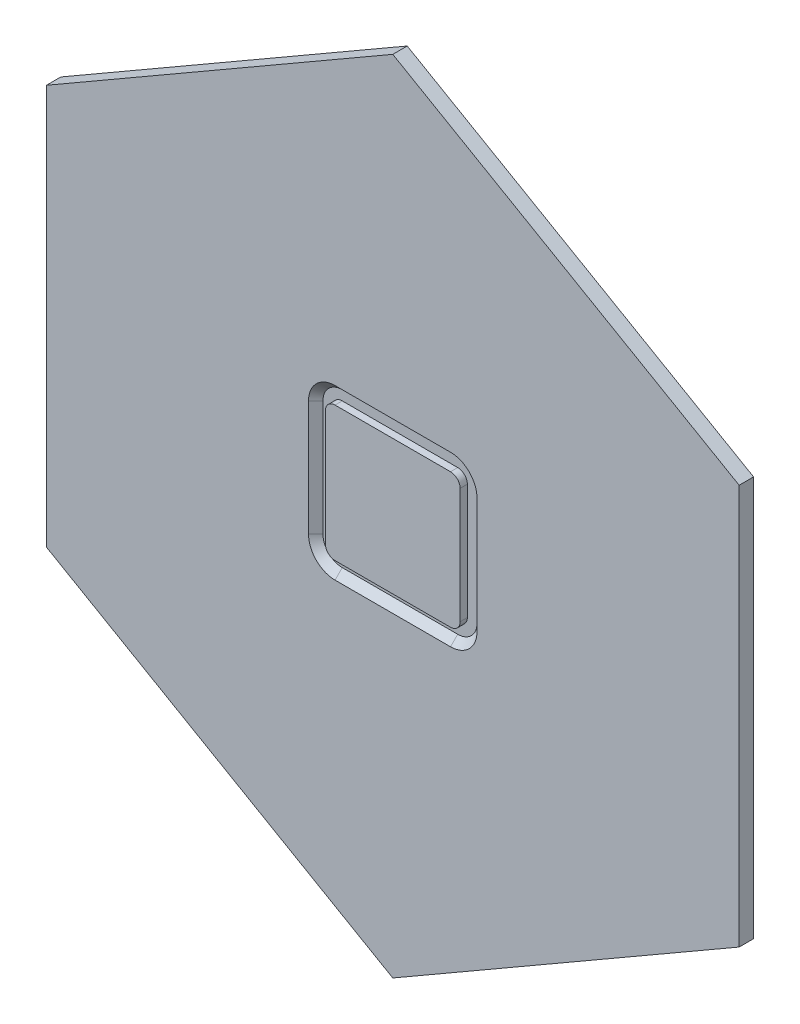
ISO-10303-21;
HEADER;
FILE_DESCRIPTION(('STEP AP214'),'2;1');
FILE_NAME('part.step','',(''),(''),'','','');
FILE_SCHEMA(('AUTOMOTIVE_DESIGN { 1 0 10303 214 1 1 1 1 }'));
ENDSEC;
DATA;
#1=APPLICATION_CONTEXT('core data for automotive mechanical design processes');
#2=APPLICATION_PROTOCOL_DEFINITION('international standard','automotive_design',2000,#1);
#3=PRODUCT_CONTEXT('',#1,'mechanical');
#4=PRODUCT('Part','Part','',(#3));
#5=PRODUCT_RELATED_PRODUCT_CATEGORY('part','',(#4));
#6=PRODUCT_DEFINITION_FORMATION('','',#4);
#7=PRODUCT_DEFINITION_CONTEXT('part definition',#1,'design');
#8=PRODUCT_DEFINITION('design','',#6,#7);
#9=PRODUCT_DEFINITION_SHAPE('','',#8);
#10=(LENGTH_UNIT() NAMED_UNIT(*) SI_UNIT(.MILLI.,.METRE.));
#11=(NAMED_UNIT(*) PLANE_ANGLE_UNIT() SI_UNIT($,.RADIAN.));
#12=(NAMED_UNIT(*) SI_UNIT($,.STERADIAN.) SOLID_ANGLE_UNIT());
#13=UNCERTAINTY_MEASURE_WITH_UNIT(LENGTH_MEASURE(1.E-05),#10,'distance_accuracy_value','');
#14=(GEOMETRIC_REPRESENTATION_CONTEXT(3) GLOBAL_UNCERTAINTY_ASSIGNED_CONTEXT((#13)) GLOBAL_UNIT_ASSIGNED_CONTEXT((#10,
#11,#12)) REPRESENTATION_CONTEXT('',''));
#15=CARTESIAN_POINT('',(0.,0.,0.));
#16=DIRECTION('',(0.,0.,1.));
#17=DIRECTION('',(1.,0.,0.));
#18=AXIS2_PLACEMENT_3D('',#15,#16,#17);
#19=CARTESIAN_POINT('',(0.,0.,9.52500000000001));
#20=DIRECTION('',(0.,0.,1.));
#21=DIRECTION('',(1.,0.,0.));
#22=AXIS2_PLACEMENT_3D('',#19,#20,#21);
#23=PLANE('',#22);
#24=DIRECTION('',(-1.,0.,0.));
#25=VECTOR('',#24,1.);
#26=CARTESIAN_POINT('',(0.,-111.2,9.52500000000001));
#27=LINE('',#26,#25);
#28=CARTESIAN_POINT('',(76.2,-111.2,9.52500000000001));
#29=VERTEX_POINT('',#28);
#30=CARTESIAN_POINT('',(-76.2,-111.2,9.52500000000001));
#31=VERTEX_POINT('',#30);
#32=EDGE_CURVE('E342',#29,#31,#27,.T.);
#33=ORIENTED_EDGE('',*,*,#32,.T.);
#34=CARTESIAN_POINT('',(-76.2,-76.2,9.52500000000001));
#35=DIRECTION('',(0.,0.,1.));
#36=DIRECTION('',(1.,0.,0.));
#37=AXIS2_PLACEMENT_3D('',#34,#35,#36);
#38=CIRCLE('',#37,35.0000000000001);
#39=CARTESIAN_POINT('',(-111.2,-76.2,9.52500000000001));
#40=VERTEX_POINT('',#39);
#41=EDGE_CURVE('E345',#31,#40,#38,.F.);
#42=ORIENTED_EDGE('',*,*,#41,.T.);
#43=DIRECTION('',(0.,1.,0.));
#44=VECTOR('',#43,1.);
#45=CARTESIAN_POINT('',(-111.2,0.,9.52500000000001));
#46=LINE('',#45,#44);
#47=CARTESIAN_POINT('',(-111.2,76.2,9.52500000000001));
#48=VERTEX_POINT('',#47);
#49=EDGE_CURVE('E325',#40,#48,#46,.T.);
#50=ORIENTED_EDGE('',*,*,#49,.T.);
#51=CARTESIAN_POINT('',(-76.2,76.2,9.52500000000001));
#52=DIRECTION('',(0.,0.,1.));
#53=DIRECTION('',(1.,0.,0.));
#54=AXIS2_PLACEMENT_3D('',#51,#52,#53);
#55=CIRCLE('',#54,35.0000000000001);
#56=CARTESIAN_POINT('',(-76.2,111.2,9.52500000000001));
#57=VERTEX_POINT('',#56);
#58=EDGE_CURVE('E327',#48,#57,#55,.F.);
#59=ORIENTED_EDGE('',*,*,#58,.T.);
#60=DIRECTION('',(1.,0.,0.));
#61=VECTOR('',#60,1.);
#62=CARTESIAN_POINT('',(0.,111.2,9.52500000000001));
#63=LINE('',#62,#61);
#64=CARTESIAN_POINT('',(76.2,111.2,9.52500000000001));
#65=VERTEX_POINT('',#64);
#66=EDGE_CURVE('E330',#57,#65,#63,.T.);
#67=ORIENTED_EDGE('',*,*,#66,.T.);
#68=CARTESIAN_POINT('',(76.2,76.2,9.52500000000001));
#69=DIRECTION('',(0.,0.,1.));
#70=DIRECTION('',(1.,0.,0.));
#71=AXIS2_PLACEMENT_3D('',#68,#69,#70);
#72=CIRCLE('',#71,35.0000000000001);
#73=CARTESIAN_POINT('',(111.2,76.2,9.52500000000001));
#74=VERTEX_POINT('',#73);
#75=EDGE_CURVE('E333',#65,#74,#72,.F.);
#76=ORIENTED_EDGE('',*,*,#75,.T.);
#77=DIRECTION('',(0.,-1.,0.));
#78=VECTOR('',#77,1.);
#79=CARTESIAN_POINT('',(111.2,0.,9.52500000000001));
#80=LINE('',#79,#78);
#81=CARTESIAN_POINT('',(111.2,-76.2,9.52500000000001));
#82=VERTEX_POINT('',#81);
#83=EDGE_CURVE('E336',#74,#82,#80,.T.);
#84=ORIENTED_EDGE('',*,*,#83,.T.);
#85=CARTESIAN_POINT('',(76.2,-76.2,9.52500000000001));
#86=DIRECTION('',(0.,0.,1.));
#87=DIRECTION('',(1.,0.,0.));
#88=AXIS2_PLACEMENT_3D('',#85,#86,#87);
#89=CIRCLE('',#88,35.0000000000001);
#90=EDGE_CURVE('E339',#82,#29,#89,.F.);
#91=ORIENTED_EDGE('',*,*,#90,.T.);
#92=EDGE_LOOP('',(#33,#42,#50,#59,#67,#76,#84,#91));
#93=FACE_BOUND('',#92,.T.);
#94=DIRECTION('',(0.,1.,0.));
#95=VECTOR('',#94,1.);
#96=CARTESIAN_POINT('',(457.2,-263.964543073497,9.52500000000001));
#97=LINE('',#96,#95);
#98=CARTESIAN_POINT('',(457.2,-263.964543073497,9.52500000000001));
#99=VERTEX_POINT('',#98);
#100=CARTESIAN_POINT('',(457.2,263.964543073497,9.52500000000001));
#101=VERTEX_POINT('',#100);
#102=EDGE_CURVE('E207',#99,#101,#97,.T.);
#103=ORIENTED_EDGE('',*,*,#102,.T.);
#104=DIRECTION('',(-0.866025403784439,0.5,0.));
#105=VECTOR('',#104,1.);
#106=CARTESIAN_POINT('',(457.2,263.964543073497,9.52500000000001));
#107=LINE('',#106,#105);
#108=CARTESIAN_POINT('',(0.,527.929086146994,9.52500000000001));
#109=VERTEX_POINT('',#108);
#110=EDGE_CURVE('E195',#101,#109,#107,.T.);
#111=ORIENTED_EDGE('',*,*,#110,.T.);
#112=DIRECTION('',(-0.866025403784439,-0.5,0.));
#113=VECTOR('',#112,1.);
#114=CARTESIAN_POINT('',(0.,527.929086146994,9.52500000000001));
#115=LINE('',#114,#113);
#116=CARTESIAN_POINT('',(-457.2,263.964543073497,9.52500000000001));
#117=VERTEX_POINT('',#116);
#118=EDGE_CURVE('E206',#109,#117,#115,.T.);
#119=ORIENTED_EDGE('',*,*,#118,.T.);
#120=DIRECTION('',(0.,-1.,0.));
#121=VECTOR('',#120,1.);
#122=CARTESIAN_POINT('',(-457.2,263.964543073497,9.52500000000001));
#123=LINE('',#122,#121);
#124=CARTESIAN_POINT('',(-457.2,-263.964543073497,9.52500000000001));
#125=VERTEX_POINT('',#124);
#126=EDGE_CURVE('E560',#117,#125,#123,.T.);
#127=ORIENTED_EDGE('',*,*,#126,.T.);
#128=DIRECTION('',(0.866025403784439,-0.5,0.));
#129=VECTOR('',#128,1.);
#130=CARTESIAN_POINT('',(-457.2,-263.964543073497,9.52500000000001));
#131=LINE('',#130,#129);
#132=CARTESIAN_POINT('',(0.,-527.929086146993,9.52500000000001));
#133=VERTEX_POINT('',#132);
#134=EDGE_CURVE('E566',#125,#133,#131,.T.);
#135=ORIENTED_EDGE('',*,*,#134,.T.);
#136=DIRECTION('',(0.866025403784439,0.5,0.));
#137=VECTOR('',#136,1.);
#138=CARTESIAN_POINT('',(0.,-527.929086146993,9.52500000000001));
#139=LINE('',#138,#137);
#140=EDGE_CURVE('E211',#133,#99,#139,.T.);
#141=ORIENTED_EDGE('',*,*,#140,.T.);
#142=EDGE_LOOP('',(#103,#111,#119,#127,#135,#141));
#143=FACE_BOUND('',#142,.T.);
#144=ADVANCED_FACE('F48',(#93,#143),#23,.T.);
#145=CARTESIAN_POINT('',(-76.2,76.2,0.));
#146=DIRECTION('',(0.,0.,1.));
#147=DIRECTION('',(1.,0.,0.));
#148=AXIS2_PLACEMENT_3D('',#145,#146,#147);
#149=PLANE('',#148);
#150=CARTESIAN_POINT('',(-76.2,76.2,0.));
#151=DIRECTION('',(0.,0.,1.));
#152=DIRECTION('',(1.,0.,0.));
#153=AXIS2_PLACEMENT_3D('',#150,#151,#152);
#154=CIRCLE('',#153,25.4750000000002);
#155=CARTESIAN_POINT('',(-76.2,101.675,0.));
#156=VERTEX_POINT('',#155);
#157=CARTESIAN_POINT('',(-101.675,76.2,0.));
#158=VERTEX_POINT('',#157);
#159=EDGE_CURVE('E60',#156,#158,#154,.T.);
#160=ORIENTED_EDGE('',*,*,#159,.T.);
#161=DIRECTION('',(0.,1.,0.));
#162=VECTOR('',#161,1.);
#163=CARTESIAN_POINT('',(-101.675,76.2,0.));
#164=LINE('',#163,#162);
#165=CARTESIAN_POINT('',(-101.675,-76.2,0.));
#166=VERTEX_POINT('',#165);
#167=EDGE_CURVE('E11',#158,#166,#164,.F.);
#168=ORIENTED_EDGE('',*,*,#167,.T.);
#169=CARTESIAN_POINT('',(-76.2,-76.2,0.));
#170=DIRECTION('',(0.,0.,1.));
#171=DIRECTION('',(1.,0.,0.));
#172=AXIS2_PLACEMENT_3D('',#169,#170,#171);
#173=CIRCLE('',#172,25.4750000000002);
#174=CARTESIAN_POINT('',(-76.2,-101.675,0.));
#175=VERTEX_POINT('',#174);
#176=EDGE_CURVE('E349',#166,#175,#173,.T.);
#177=ORIENTED_EDGE('',*,*,#176,.T.);
#178=DIRECTION('',(-1.,0.,0.));
#179=VECTOR('',#178,1.);
#180=CARTESIAN_POINT('',(76.2,-101.675,0.));
#181=LINE('',#180,#179);
#182=CARTESIAN_POINT('',(76.2,-101.675,0.));
#183=VERTEX_POINT('',#182);
#184=EDGE_CURVE('E353',#175,#183,#181,.F.);
#185=ORIENTED_EDGE('',*,*,#184,.T.);
#186=CARTESIAN_POINT('',(76.2,-76.2,0.));
#187=DIRECTION('',(0.,0.,1.));
#188=DIRECTION('',(1.,0.,0.));
#189=AXIS2_PLACEMENT_3D('',#186,#187,#188);
#190=CIRCLE('',#189,25.4750000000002);
#191=CARTESIAN_POINT('',(101.675,-76.2,0.));
#192=VERTEX_POINT('',#191);
#193=EDGE_CURVE('E356',#183,#192,#190,.T.);
#194=ORIENTED_EDGE('',*,*,#193,.T.);
#195=DIRECTION('',(0.,-1.,0.));
#196=VECTOR('',#195,1.);
#197=CARTESIAN_POINT('',(101.675,-76.2,0.));
#198=LINE('',#197,#196);
#199=CARTESIAN_POINT('',(101.675,76.2,0.));
#200=VERTEX_POINT('',#199);
#201=EDGE_CURVE('E359',#192,#200,#198,.F.);
#202=ORIENTED_EDGE('',*,*,#201,.T.);
#203=CARTESIAN_POINT('',(76.2,76.2,0.));
#204=DIRECTION('',(0.,0.,1.));
#205=DIRECTION('',(1.,0.,0.));
#206=AXIS2_PLACEMENT_3D('',#203,#204,#205);
#207=CIRCLE('',#206,25.4750000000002);
#208=CARTESIAN_POINT('',(76.2,101.675,0.));
#209=VERTEX_POINT('',#208);
#210=EDGE_CURVE('E362',#200,#209,#207,.T.);
#211=ORIENTED_EDGE('',*,*,#210,.T.);
#212=DIRECTION('',(1.,0.,0.));
#213=VECTOR('',#212,1.);
#214=CARTESIAN_POINT('',(-76.2,101.675,0.));
#215=LINE('',#214,#213);
#216=EDGE_CURVE('E365',#209,#156,#215,.F.);
#217=ORIENTED_EDGE('',*,*,#216,.T.);
#218=EDGE_LOOP('',(#160,#168,#177,#185,#194,#202,#211,#217));
#219=FACE_BOUND('',#218,.T.);
#220=CARTESIAN_POINT('',(-76.2,-76.2,0.));
#221=DIRECTION('',(0.,0.,1.));
#222=DIRECTION('',(1.,0.,0.));
#223=AXIS2_PLACEMENT_3D('',#220,#221,#222);
#224=CIRCLE('',#223,12.7);
#225=CARTESIAN_POINT('',(-88.9,-76.2,0.));
#226=VERTEX_POINT('',#225);
#227=CARTESIAN_POINT('',(-76.2,-88.9,0.));
#228=VERTEX_POINT('',#227);
#229=EDGE_CURVE('E269',#226,#228,#224,.T.);
#230=ORIENTED_EDGE('',*,*,#229,.F.);
#231=DIRECTION('',(0.,-1.,0.));
#232=VECTOR('',#231,1.);
#233=CARTESIAN_POINT('',(-88.9000000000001,76.2,0.));
#234=LINE('',#233,#232);
#235=CARTESIAN_POINT('',(-88.9000000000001,76.2,0.));
#236=VERTEX_POINT('',#235);
#237=EDGE_CURVE('E240',#236,#226,#234,.T.);
#238=ORIENTED_EDGE('',*,*,#237,.F.);
#239=CARTESIAN_POINT('',(-76.2,76.2,0.));
#240=DIRECTION('',(0.,0.,1.));
#241=DIRECTION('',(1.,0.,0.));
#242=AXIS2_PLACEMENT_3D('',#239,#240,#241);
#243=CIRCLE('',#242,12.7);
#244=CARTESIAN_POINT('',(-76.2,88.9,0.));
#245=VERTEX_POINT('',#244);
#246=EDGE_CURVE('E293',#245,#236,#243,.T.);
#247=ORIENTED_EDGE('',*,*,#246,.F.);
#248=DIRECTION('',(-1.,0.,0.));
#249=VECTOR('',#248,1.);
#250=CARTESIAN_POINT('',(-76.2,88.9,0.));
#251=LINE('',#250,#249);
#252=CARTESIAN_POINT('',(76.2,88.9,0.));
#253=VERTEX_POINT('',#252);
#254=EDGE_CURVE('E289',#253,#245,#251,.T.);
#255=ORIENTED_EDGE('',*,*,#254,.F.);
#256=CARTESIAN_POINT('',(76.2,76.2,0.));
#257=DIRECTION('',(0.,0.,1.));
#258=DIRECTION('',(1.,0.,0.));
#259=AXIS2_PLACEMENT_3D('',#256,#257,#258);
#260=CIRCLE('',#259,12.7);
#261=CARTESIAN_POINT('',(88.9,76.2,0.));
#262=VERTEX_POINT('',#261);
#263=EDGE_CURVE('E285',#262,#253,#260,.T.);
#264=ORIENTED_EDGE('',*,*,#263,.F.);
#265=DIRECTION('',(0.,1.,0.));
#266=VECTOR('',#265,1.);
#267=CARTESIAN_POINT('',(88.9,-76.2,0.));
#268=LINE('',#267,#266);
#269=CARTESIAN_POINT('',(88.9,-76.2,0.));
#270=VERTEX_POINT('',#269);
#271=EDGE_CURVE('E281',#270,#262,#268,.T.);
#272=ORIENTED_EDGE('',*,*,#271,.F.);
#273=CARTESIAN_POINT('',(76.2,-76.2,0.));
#274=DIRECTION('',(0.,0.,1.));
#275=DIRECTION('',(1.,0.,0.));
#276=AXIS2_PLACEMENT_3D('',#273,#274,#275);
#277=CIRCLE('',#276,12.7);
#278=CARTESIAN_POINT('',(76.2,-88.9,0.));
#279=VERTEX_POINT('',#278);
#280=EDGE_CURVE('E277',#279,#270,#277,.T.);
#281=ORIENTED_EDGE('',*,*,#280,.F.);
#282=DIRECTION('',(1.,0.,0.));
#283=VECTOR('',#282,1.);
#284=CARTESIAN_POINT('',(76.2,-88.9,0.));
#285=LINE('',#284,#283);
#286=EDGE_CURVE('E273',#228,#279,#285,.T.);
#287=ORIENTED_EDGE('',*,*,#286,.F.);
#288=EDGE_LOOP('',(#230,#238,#247,#255,#264,#272,#281,#287));
#289=FACE_BOUND('',#288,.T.);
#290=ADVANCED_FACE('F420',(#219,#289),#149,.T.);
#291=CARTESIAN_POINT('',(-76.2,-76.2,9.52500000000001));
#292=DIRECTION('',(0.,0.,-1.));
#293=DIRECTION('',(-1.,0.,0.));
#294=AXIS2_PLACEMENT_3D('',#291,#292,#293);
#295=CYLINDRICAL_SURFACE('',#294,12.7);
#296=ORIENTED_EDGE('',*,*,#229,.T.);
#297=DIRECTION('',(0.,0.,-1.));
#298=VECTOR('',#297,1.);
#299=CARTESIAN_POINT('',(-76.2,-88.9,9.52500000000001));
#300=LINE('',#299,#298);
#301=CARTESIAN_POINT('',(-76.2,-88.9,9.52500000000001));
#302=VERTEX_POINT('',#301);
#303=EDGE_CURVE('E321',#302,#228,#300,.T.);
#304=ORIENTED_EDGE('',*,*,#303,.F.);
#305=CARTESIAN_POINT('',(-76.2,-76.2,9.52500000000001));
#306=DIRECTION('',(0.,0.,1.));
#307=DIRECTION('',(1.,0.,0.));
#308=AXIS2_PLACEMENT_3D('',#305,#306,#307);
#309=CIRCLE('',#308,12.7);
#310=CARTESIAN_POINT('',(-88.9,-76.2,9.52500000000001));
#311=VERTEX_POINT('',#310);
#312=EDGE_CURVE('E235',#311,#302,#309,.T.);
#313=ORIENTED_EDGE('',*,*,#312,.F.);
#314=DIRECTION('',(0.,0.,-1.));
#315=VECTOR('',#314,1.);
#316=CARTESIAN_POINT('',(-88.9,-76.2,9.52500000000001));
#317=LINE('',#316,#315);
#318=EDGE_CURVE('E268',#311,#226,#317,.T.);
#319=ORIENTED_EDGE('',*,*,#318,.T.);
#320=EDGE_LOOP('',(#296,#304,#313,#319));
#321=FACE_BOUND('',#320,.T.);
#322=ADVANCED_FACE('F454',(#321),#295,.T.);
#323=CARTESIAN_POINT('',(76.2,-88.9,9.52500000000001));
#324=DIRECTION('',(0.,1.,0.));
#325=DIRECTION('',(0.,0.,1.));
#326=AXIS2_PLACEMENT_3D('',#323,#324,#325);
#327=PLANE('',#326);
#328=ORIENTED_EDGE('',*,*,#286,.T.);
#329=DIRECTION('',(0.,0.,-1.));
#330=VECTOR('',#329,1.);
#331=CARTESIAN_POINT('',(76.2,-88.9,9.52500000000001));
#332=LINE('',#331,#330);
#333=CARTESIAN_POINT('',(76.2,-88.9,9.52500000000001));
#334=VERTEX_POINT('',#333);
#335=EDGE_CURVE('E318',#334,#279,#332,.T.);
#336=ORIENTED_EDGE('',*,*,#335,.F.);
#337=DIRECTION('',(1.,0.,0.));
#338=VECTOR('',#337,1.);
#339=CARTESIAN_POINT('',(76.2,-88.9,9.52500000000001));
#340=LINE('',#339,#338);
#341=EDGE_CURVE('E239',#302,#334,#340,.T.);
#342=ORIENTED_EDGE('',*,*,#341,.F.);
#343=ORIENTED_EDGE('',*,*,#303,.T.);
#344=EDGE_LOOP('',(#328,#336,#342,#343));
#345=FACE_BOUND('',#344,.T.);
#346=ADVANCED_FACE('F495',(#345),#327,.F.);
#347=CARTESIAN_POINT('',(76.2,-76.2,9.52500000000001));
#348=DIRECTION('',(0.,0.,-1.));
#349=DIRECTION('',(-1.,0.,0.));
#350=AXIS2_PLACEMENT_3D('',#347,#348,#349);
#351=CYLINDRICAL_SURFACE('',#350,12.7);
#352=ORIENTED_EDGE('',*,*,#280,.T.);
#353=DIRECTION('',(0.,0.,-1.));
#354=VECTOR('',#353,1.);
#355=CARTESIAN_POINT('',(88.9,-76.2,9.52500000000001));
#356=LINE('',#355,#354);
#357=CARTESIAN_POINT('',(88.9,-76.2,9.52500000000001));
#358=VERTEX_POINT('',#357);
#359=EDGE_CURVE('E315',#358,#270,#356,.T.);
#360=ORIENTED_EDGE('',*,*,#359,.F.);
#361=CARTESIAN_POINT('',(76.2,-76.2,9.52500000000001));
#362=DIRECTION('',(0.,0.,1.));
#363=DIRECTION('',(1.,0.,0.));
#364=AXIS2_PLACEMENT_3D('',#361,#362,#363);
#365=CIRCLE('',#364,12.7);
#366=EDGE_CURVE('E244',#334,#358,#365,.T.);
#367=ORIENTED_EDGE('',*,*,#366,.F.);
#368=ORIENTED_EDGE('',*,*,#335,.T.);
#369=EDGE_LOOP('',(#352,#360,#367,#368));
#370=FACE_BOUND('',#369,.T.);
#371=ADVANCED_FACE('F492',(#370),#351,.T.);
#372=CARTESIAN_POINT('',(88.9,-76.2,9.52500000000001));
#373=DIRECTION('',(-1.,0.,0.));
#374=DIRECTION('',(0.,0.,1.));
#375=AXIS2_PLACEMENT_3D('',#372,#373,#374);
#376=PLANE('',#375);
#377=ORIENTED_EDGE('',*,*,#271,.T.);
#378=DIRECTION('',(0.,0.,-1.));
#379=VECTOR('',#378,1.);
#380=CARTESIAN_POINT('',(88.9,76.2,9.52500000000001));
#381=LINE('',#380,#379);
#382=CARTESIAN_POINT('',(88.9,76.2,9.52500000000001));
#383=VERTEX_POINT('',#382);
#384=EDGE_CURVE('E312',#383,#262,#381,.T.);
#385=ORIENTED_EDGE('',*,*,#384,.F.);
#386=DIRECTION('',(0.,1.,0.));
#387=VECTOR('',#386,1.);
#388=CARTESIAN_POINT('',(88.9,-76.2,9.52500000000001));
#389=LINE('',#388,#387);
#390=EDGE_CURVE('E248',#358,#383,#389,.T.);
#391=ORIENTED_EDGE('',*,*,#390,.F.);
#392=ORIENTED_EDGE('',*,*,#359,.T.);
#393=EDGE_LOOP('',(#377,#385,#391,#392));
#394=FACE_BOUND('',#393,.T.);
#395=ADVANCED_FACE('F489',(#394),#376,.F.);
#396=CARTESIAN_POINT('',(76.2,76.2,9.52500000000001));
#397=DIRECTION('',(0.,0.,-1.));
#398=DIRECTION('',(-1.,0.,0.));
#399=AXIS2_PLACEMENT_3D('',#396,#397,#398);
#400=CYLINDRICAL_SURFACE('',#399,12.7);
#401=ORIENTED_EDGE('',*,*,#263,.T.);
#402=DIRECTION('',(0.,0.,-1.));
#403=VECTOR('',#402,1.);
#404=CARTESIAN_POINT('',(76.2,88.8999999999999,9.52500000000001));
#405=LINE('',#404,#403);
#406=CARTESIAN_POINT('',(76.2,88.8999999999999,9.52500000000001));
#407=VERTEX_POINT('',#406);
#408=EDGE_CURVE('E309',#407,#253,#405,.T.);
#409=ORIENTED_EDGE('',*,*,#408,.F.);
#410=CARTESIAN_POINT('',(76.2,76.2,9.52500000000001));
#411=DIRECTION('',(0.,0.,1.));
#412=DIRECTION('',(1.,0.,0.));
#413=AXIS2_PLACEMENT_3D('',#410,#411,#412);
#414=CIRCLE('',#413,12.7);
#415=EDGE_CURVE('E252',#383,#407,#414,.T.);
#416=ORIENTED_EDGE('',*,*,#415,.F.);
#417=ORIENTED_EDGE('',*,*,#384,.T.);
#418=EDGE_LOOP('',(#401,#409,#416,#417));
#419=FACE_BOUND('',#418,.T.);
#420=ADVANCED_FACE('F485',(#419),#400,.T.);
#421=CARTESIAN_POINT('',(-76.2,88.8999999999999,9.52500000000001));
#422=DIRECTION('',(0.,-1.,0.));
#423=DIRECTION('',(0.,0.,-1.));
#424=AXIS2_PLACEMENT_3D('',#421,#422,#423);
#425=PLANE('',#424);
#426=ORIENTED_EDGE('',*,*,#254,.T.);
#427=DIRECTION('',(0.,0.,-1.));
#428=VECTOR('',#427,1.);
#429=CARTESIAN_POINT('',(-76.2,88.9,9.52500000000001));
#430=LINE('',#429,#428);
#431=CARTESIAN_POINT('',(-76.2,88.9,9.52500000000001));
#432=VERTEX_POINT('',#431);
#433=EDGE_CURVE('E306',#432,#245,#430,.T.);
#434=ORIENTED_EDGE('',*,*,#433,.F.);
#435=DIRECTION('',(-1.,0.,0.));
#436=VECTOR('',#435,1.);
#437=CARTESIAN_POINT('',(-76.2,88.8999999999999,9.52500000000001));
#438=LINE('',#437,#436);
#439=EDGE_CURVE('E256',#407,#432,#438,.T.);
#440=ORIENTED_EDGE('',*,*,#439,.F.);
#441=ORIENTED_EDGE('',*,*,#408,.T.);
#442=EDGE_LOOP('',(#426,#434,#440,#441));
#443=FACE_BOUND('',#442,.T.);
#444=ADVANCED_FACE('F481',(#443),#425,.F.);
#445=CARTESIAN_POINT('',(-76.2,76.2,9.52500000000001));
#446=DIRECTION('',(0.,0.,-1.));
#447=DIRECTION('',(-1.,0.,0.));
#448=AXIS2_PLACEMENT_3D('',#445,#446,#447);
#449=CYLINDRICAL_SURFACE('',#448,12.7);
#450=ORIENTED_EDGE('',*,*,#246,.T.);
#451=DIRECTION('',(0.,0.,-1.));
#452=VECTOR('',#451,1.);
#453=CARTESIAN_POINT('',(-88.9000000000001,76.2,9.52500000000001));
#454=LINE('',#453,#452);
#455=CARTESIAN_POINT('',(-88.9000000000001,76.2,9.52500000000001));
#456=VERTEX_POINT('',#455);
#457=EDGE_CURVE('E303',#456,#236,#454,.T.);
#458=ORIENTED_EDGE('',*,*,#457,.F.);
#459=CARTESIAN_POINT('',(-76.2,76.2,9.52500000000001));
#460=DIRECTION('',(0.,0.,1.));
#461=DIRECTION('',(1.,0.,0.));
#462=AXIS2_PLACEMENT_3D('',#459,#460,#461);
#463=CIRCLE('',#462,12.7);
#464=EDGE_CURVE('E260',#432,#456,#463,.T.);
#465=ORIENTED_EDGE('',*,*,#464,.F.);
#466=ORIENTED_EDGE('',*,*,#433,.T.);
#467=EDGE_LOOP('',(#450,#458,#465,#466));
#468=FACE_BOUND('',#467,.T.);
#469=ADVANCED_FACE('F467',(#468),#449,.T.);
#470=CARTESIAN_POINT('',(-88.9000000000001,76.2,9.52500000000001));
#471=DIRECTION('',(1.,0.,0.));
#472=DIRECTION('',(0.,1.,0.));
#473=AXIS2_PLACEMENT_3D('',#470,#471,#472);
#474=PLANE('',#473);
#475=ORIENTED_EDGE('',*,*,#237,.T.);
#476=ORIENTED_EDGE('',*,*,#318,.F.);
#477=DIRECTION('',(0.,-1.,0.));
#478=VECTOR('',#477,1.);
#479=CARTESIAN_POINT('',(-88.9000000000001,76.2,9.52500000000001));
#480=LINE('',#479,#478);
#481=EDGE_CURVE('E264',#456,#311,#480,.T.);
#482=ORIENTED_EDGE('',*,*,#481,.F.);
#483=ORIENTED_EDGE('',*,*,#457,.T.);
#484=EDGE_LOOP('',(#475,#476,#482,#483));
#485=FACE_BOUND('',#484,.T.);
#486=ADVANCED_FACE('F459',(#485),#474,.F.);
#487=ORIENTED_EDGE('',*,*,#312,.T.);
#488=ORIENTED_EDGE('',*,*,#341,.T.);
#489=ORIENTED_EDGE('',*,*,#366,.T.);
#490=ORIENTED_EDGE('',*,*,#390,.T.);
#491=ORIENTED_EDGE('',*,*,#415,.T.);
#492=ORIENTED_EDGE('',*,*,#439,.T.);
#493=ORIENTED_EDGE('',*,*,#464,.T.);
#494=ORIENTED_EDGE('',*,*,#481,.T.);
#495=EDGE_LOOP('',(#487,#488,#489,#490,#491,#492,#493,#494));
#496=FACE_BOUND('',#495,.T.);
#497=ADVANCED_FACE('F447',(#496),#23,.T.);
#498=CARTESIAN_POINT('',(76.2,76.2,-0.0749999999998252));
#499=DIRECTION('',(0.,0.,1.));
#500=DIRECTION('',(1.,0.,0.));
#501=AXIS2_PLACEMENT_3D('',#498,#499,#500);
#502=CONICAL_SURFACE('',#501,25.4,0.785398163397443);
#503=DIRECTION('',(-0.707106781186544,0.,-0.707106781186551));
#504=VECTOR('',#503,1.);
#505=CARTESIAN_POINT('',(111.2,76.2,9.52500000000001));
#506=LINE('',#505,#504);
#507=EDGE_CURVE('E387',#74,#200,#506,.T.);
#508=ORIENTED_EDGE('',*,*,#507,.F.);
#509=ORIENTED_EDGE('',*,*,#75,.F.);
#510=DIRECTION('',(0.,0.707106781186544,0.707106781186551));
#511=VECTOR('',#510,1.);
#512=CARTESIAN_POINT('',(76.2,101.6,-0.0749999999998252));
#513=LINE('',#512,#511);
#514=EDGE_CURVE('E53',#209,#65,#513,.T.);
#515=ORIENTED_EDGE('',*,*,#514,.F.);
#516=ORIENTED_EDGE('',*,*,#210,.F.);
#517=EDGE_LOOP('',(#508,#509,#515,#516));
#518=FACE_BOUND('',#517,.T.);
#519=ADVANCED_FACE('F51',(#518),#502,.F.);
#520=CARTESIAN_POINT('',(-76.2,101.6,-0.0749999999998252));
#521=DIRECTION('',(0.,0.707106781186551,-0.707106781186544));
#522=DIRECTION('',(-1.,0.,0.));
#523=AXIS2_PLACEMENT_3D('',#520,#521,#522);
#524=PLANE('',#523);
#525=ORIENTED_EDGE('',*,*,#514,.T.);
#526=ORIENTED_EDGE('',*,*,#66,.F.);
#527=DIRECTION('',(0.,0.707106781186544,0.707106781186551));
#528=VECTOR('',#527,1.);
#529=CARTESIAN_POINT('',(-76.2,101.6,-0.0749999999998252));
#530=LINE('',#529,#528);
#531=EDGE_CURVE('E384',#156,#57,#530,.T.);
#532=ORIENTED_EDGE('',*,*,#531,.F.);
#533=ORIENTED_EDGE('',*,*,#216,.F.);
#534=EDGE_LOOP('',(#525,#526,#532,#533));
#535=FACE_BOUND('',#534,.T.);
#536=ADVANCED_FACE('F404',(#535),#524,.F.);
#537=CARTESIAN_POINT('',(101.6,-76.2,-0.0749999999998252));
#538=DIRECTION('',(0.707106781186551,0.,-0.707106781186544));
#539=DIRECTION('',(0.,1.,0.));
#540=AXIS2_PLACEMENT_3D('',#537,#538,#539);
#541=PLANE('',#540);
#542=ORIENTED_EDGE('',*,*,#507,.T.);
#543=ORIENTED_EDGE('',*,*,#201,.F.);
#544=DIRECTION('',(-0.707106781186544,0.,-0.707106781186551));
#545=VECTOR('',#544,1.);
#546=CARTESIAN_POINT('',(111.2,-76.2,9.52500000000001));
#547=LINE('',#546,#545);
#548=EDGE_CURVE('E380',#82,#192,#547,.T.);
#549=ORIENTED_EDGE('',*,*,#548,.F.);
#550=ORIENTED_EDGE('',*,*,#83,.F.);
#551=EDGE_LOOP('',(#542,#543,#549,#550));
#552=FACE_BOUND('',#551,.T.);
#553=ADVANCED_FACE('F435',(#552),#541,.F.);
#554=CARTESIAN_POINT('',(-76.2,76.2,-0.0749999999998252));
#555=DIRECTION('',(0.,0.,1.));
#556=DIRECTION('',(1.,0.,0.));
#557=AXIS2_PLACEMENT_3D('',#554,#555,#556);
#558=CONICAL_SURFACE('',#557,25.4,0.785398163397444);
#559=ORIENTED_EDGE('',*,*,#531,.T.);
#560=ORIENTED_EDGE('',*,*,#58,.F.);
#561=DIRECTION('',(-0.707106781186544,0.,0.707106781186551));
#562=VECTOR('',#561,1.);
#563=CARTESIAN_POINT('',(-101.6,76.2,-0.0749999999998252));
#564=LINE('',#563,#562);
#565=EDGE_CURVE('E376',#158,#48,#564,.T.);
#566=ORIENTED_EDGE('',*,*,#565,.F.);
#567=ORIENTED_EDGE('',*,*,#159,.F.);
#568=EDGE_LOOP('',(#559,#560,#566,#567));
#569=FACE_BOUND('',#568,.T.);
#570=ADVANCED_FACE('F414',(#569),#558,.F.);
#571=CARTESIAN_POINT('',(76.2,-76.2,-0.0749999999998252));
#572=DIRECTION('',(0.,0.,1.));
#573=DIRECTION('',(1.,0.,0.));
#574=AXIS2_PLACEMENT_3D('',#571,#572,#573);
#575=CONICAL_SURFACE('',#574,25.4,0.785398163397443);
#576=ORIENTED_EDGE('',*,*,#548,.T.);
#577=ORIENTED_EDGE('',*,*,#193,.F.);
#578=DIRECTION('',(0.,0.707106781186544,-0.707106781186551));
#579=VECTOR('',#578,1.);
#580=CARTESIAN_POINT('',(76.2,-111.2,9.52500000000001));
#581=LINE('',#580,#579);
#582=EDGE_CURVE('E372',#29,#183,#581,.T.);
#583=ORIENTED_EDGE('',*,*,#582,.F.);
#584=ORIENTED_EDGE('',*,*,#90,.F.);
#585=EDGE_LOOP('',(#576,#577,#583,#584));
#586=FACE_BOUND('',#585,.T.);
#587=ADVANCED_FACE('F434',(#586),#575,.F.);
#588=CARTESIAN_POINT('',(-101.6,76.2,-0.0749999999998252));
#589=DIRECTION('',(-0.707106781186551,0.,-0.707106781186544));
#590=DIRECTION('',(0.,-1.,0.));
#591=AXIS2_PLACEMENT_3D('',#588,#589,#590);
#592=PLANE('',#591);
#593=ORIENTED_EDGE('',*,*,#565,.T.);
#594=ORIENTED_EDGE('',*,*,#49,.F.);
#595=DIRECTION('',(-0.707106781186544,0.,0.707106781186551));
#596=VECTOR('',#595,1.);
#597=CARTESIAN_POINT('',(-101.6,-76.2,-0.0749999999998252));
#598=LINE('',#597,#596);
#599=EDGE_CURVE('E229',#166,#40,#598,.T.);
#600=ORIENTED_EDGE('',*,*,#599,.F.);
#601=ORIENTED_EDGE('',*,*,#167,.F.);
#602=EDGE_LOOP('',(#593,#594,#600,#601));
#603=FACE_BOUND('',#602,.T.);
#604=ADVANCED_FACE('F417',(#603),#592,.F.);
#605=CARTESIAN_POINT('',(76.2,-101.6,-0.0749999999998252));
#606=DIRECTION('',(0.,-0.707106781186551,-0.707106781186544));
#607=DIRECTION('',(1.,0.,0.));
#608=AXIS2_PLACEMENT_3D('',#605,#606,#607);
#609=PLANE('',#608);
#610=ORIENTED_EDGE('',*,*,#582,.T.);
#611=ORIENTED_EDGE('',*,*,#184,.F.);
#612=DIRECTION('',(0.,0.707106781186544,-0.707106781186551));
#613=VECTOR('',#612,1.);
#614=CARTESIAN_POINT('',(-76.2,-111.2,9.52500000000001));
#615=LINE('',#614,#613);
#616=EDGE_CURVE('E222',#31,#175,#615,.T.);
#617=ORIENTED_EDGE('',*,*,#616,.F.);
#618=ORIENTED_EDGE('',*,*,#32,.F.);
#619=EDGE_LOOP('',(#610,#611,#617,#618));
#620=FACE_BOUND('',#619,.T.);
#621=ADVANCED_FACE('F430',(#620),#609,.F.);
#622=CARTESIAN_POINT('',(-76.2,-76.2,-0.0749999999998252));
#623=DIRECTION('',(0.,0.,1.));
#624=DIRECTION('',(1.,0.,0.));
#625=AXIS2_PLACEMENT_3D('',#622,#623,#624);
#626=CONICAL_SURFACE('',#625,25.4,0.785398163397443);
#627=ORIENTED_EDGE('',*,*,#599,.T.);
#628=ORIENTED_EDGE('',*,*,#41,.F.);
#629=ORIENTED_EDGE('',*,*,#616,.T.);
#630=ORIENTED_EDGE('',*,*,#176,.F.);
#631=EDGE_LOOP('',(#627,#628,#629,#630));
#632=FACE_BOUND('',#631,.T.);
#633=ADVANCED_FACE('F425',(#632),#626,.F.);
#634=CARTESIAN_POINT('',(457.2,-263.964543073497,9.52500000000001));
#635=DIRECTION('',(-1.,0.,0.));
#636=DIRECTION('',(0.,-1.,0.));
#637=AXIS2_PLACEMENT_3D('',#634,#635,#636);
#638=PLANE('',#637);
#639=DIRECTION('',(0.,1.,0.));
#640=VECTOR('',#639,1.);
#641=CARTESIAN_POINT('',(457.2,-263.964543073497,-9.52500000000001));
#642=LINE('',#641,#640);
#643=CARTESIAN_POINT('',(457.2,-263.964543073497,-9.52500000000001));
#644=VERTEX_POINT('',#643);
#645=CARTESIAN_POINT('',(457.2,263.964543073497,-9.52500000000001));
#646=VERTEX_POINT('',#645);
#647=EDGE_CURVE('E220',#644,#646,#642,.T.);
#648=ORIENTED_EDGE('',*,*,#647,.T.);
#649=DIRECTION('',(0.,0.,-1.));
#650=VECTOR('',#649,1.);
#651=CARTESIAN_POINT('',(457.2,263.964543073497,9.52500000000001));
#652=LINE('',#651,#650);
#653=EDGE_CURVE('E199',#101,#646,#652,.T.);
#654=ORIENTED_EDGE('',*,*,#653,.F.);
#655=ORIENTED_EDGE('',*,*,#102,.F.);
#656=DIRECTION('',(0.,0.,-1.));
#657=VECTOR('',#656,1.);
#658=CARTESIAN_POINT('',(457.2,-263.964543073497,9.52500000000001));
#659=LINE('',#658,#657);
#660=EDGE_CURVE('E540',#99,#644,#659,.T.);
#661=ORIENTED_EDGE('',*,*,#660,.T.);
#662=EDGE_LOOP('',(#648,#654,#655,#661));
#663=FACE_BOUND('',#662,.T.);
#664=ADVANCED_FACE('F218',(#663),#638,.F.);
#665=CARTESIAN_POINT('',(457.2,263.964543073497,9.52500000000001));
#666=DIRECTION('',(-0.5,-0.866025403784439,0.));
#667=DIRECTION('',(0.866025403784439,-0.5,0.));
#668=AXIS2_PLACEMENT_3D('',#665,#666,#667);
#669=PLANE('',#668);
#670=DIRECTION('',(-0.866025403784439,0.5,0.));
#671=VECTOR('',#670,1.);
#672=CARTESIAN_POINT('',(457.2,263.964543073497,-9.52500000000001));
#673=LINE('',#672,#671);
#674=CARTESIAN_POINT('',(0.,527.929086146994,-9.52500000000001));
#675=VERTEX_POINT('',#674);
#676=EDGE_CURVE('E519',#646,#675,#673,.T.);
#677=ORIENTED_EDGE('',*,*,#676,.T.);
#678=DIRECTION('',(0.,0.,-1.));
#679=VECTOR('',#678,1.);
#680=CARTESIAN_POINT('',(0.,527.929086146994,9.52500000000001));
#681=LINE('',#680,#679);
#682=EDGE_CURVE('E202',#109,#675,#681,.T.);
#683=ORIENTED_EDGE('',*,*,#682,.F.);
#684=ORIENTED_EDGE('',*,*,#110,.F.);
#685=ORIENTED_EDGE('',*,*,#653,.T.);
#686=EDGE_LOOP('',(#677,#683,#684,#685));
#687=FACE_BOUND('',#686,.T.);
#688=ADVANCED_FACE('F197',(#687),#669,.F.);
#689=CARTESIAN_POINT('',(0.,527.929086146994,9.52500000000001));
#690=DIRECTION('',(0.5,-0.866025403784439,0.));
#691=DIRECTION('',(0.866025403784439,0.5,0.));
#692=AXIS2_PLACEMENT_3D('',#689,#690,#691);
#693=PLANE('',#692);
#694=DIRECTION('',(-0.866025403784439,-0.5,0.));
#695=VECTOR('',#694,1.);
#696=CARTESIAN_POINT('',(0.,527.929086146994,-9.52500000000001));
#697=LINE('',#696,#695);
#698=CARTESIAN_POINT('',(-457.2,263.964543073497,-9.52500000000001));
#699=VERTEX_POINT('',#698);
#700=EDGE_CURVE('E525',#675,#699,#697,.T.);
#701=ORIENTED_EDGE('',*,*,#700,.T.);
#702=DIRECTION('',(0.,0.,-1.));
#703=VECTOR('',#702,1.);
#704=CARTESIAN_POINT('',(-457.2,263.964543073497,9.52500000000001));
#705=LINE('',#704,#703);
#706=EDGE_CURVE('E231',#117,#699,#705,.T.);
#707=ORIENTED_EDGE('',*,*,#706,.F.);
#708=ORIENTED_EDGE('',*,*,#118,.F.);
#709=ORIENTED_EDGE('',*,*,#682,.T.);
#710=EDGE_LOOP('',(#701,#707,#708,#709));
#711=FACE_BOUND('',#710,.T.);
#712=ADVANCED_FACE('F578',(#711),#693,.F.);
#713=CARTESIAN_POINT('',(-457.2,263.964543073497,9.52500000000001));
#714=DIRECTION('',(1.,0.,0.));
#715=DIRECTION('',(0.,0.,-1.));
#716=AXIS2_PLACEMENT_3D('',#713,#714,#715);
#717=PLANE('',#716);
#718=DIRECTION('',(0.,-1.,0.));
#719=VECTOR('',#718,1.);
#720=CARTESIAN_POINT('',(-457.2,263.964543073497,-9.52500000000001));
#721=LINE('',#720,#719);
#722=CARTESIAN_POINT('',(-457.2,-263.964543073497,-9.52500000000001));
#723=VERTEX_POINT('',#722);
#724=EDGE_CURVE('E532',#699,#723,#721,.T.);
#725=ORIENTED_EDGE('',*,*,#724,.T.);
#726=DIRECTION('',(0.,0.,-1.));
#727=VECTOR('',#726,1.);
#728=CARTESIAN_POINT('',(-457.2,-263.964543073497,9.52500000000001));
#729=LINE('',#728,#727);
#730=EDGE_CURVE('E547',#125,#723,#729,.T.);
#731=ORIENTED_EDGE('',*,*,#730,.F.);
#732=ORIENTED_EDGE('',*,*,#126,.F.);
#733=ORIENTED_EDGE('',*,*,#706,.T.);
#734=EDGE_LOOP('',(#725,#731,#732,#733));
#735=FACE_BOUND('',#734,.T.);
#736=ADVANCED_FACE('F558',(#735),#717,.F.);
#737=CARTESIAN_POINT('',(-457.2,-263.964543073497,9.52500000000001));
#738=DIRECTION('',(0.5,0.866025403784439,0.));
#739=DIRECTION('',(-0.866025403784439,0.5,0.));
#740=AXIS2_PLACEMENT_3D('',#737,#738,#739);
#741=PLANE('',#740);
#742=DIRECTION('',(0.866025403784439,-0.5,0.));
#743=VECTOR('',#742,1.);
#744=CARTESIAN_POINT('',(-457.2,-263.964543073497,-9.52500000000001));
#745=LINE('',#744,#743);
#746=CARTESIAN_POINT('',(0.,-527.929086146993,-9.52500000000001));
#747=VERTEX_POINT('',#746);
#748=EDGE_CURVE('E535',#723,#747,#745,.T.);
#749=ORIENTED_EDGE('',*,*,#748,.T.);
#750=DIRECTION('',(0.,0.,-1.));
#751=VECTOR('',#750,1.);
#752=CARTESIAN_POINT('',(0.,-527.929086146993,9.52500000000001));
#753=LINE('',#752,#751);
#754=EDGE_CURVE('E543',#133,#747,#753,.T.);
#755=ORIENTED_EDGE('',*,*,#754,.F.);
#756=ORIENTED_EDGE('',*,*,#134,.F.);
#757=ORIENTED_EDGE('',*,*,#730,.T.);
#758=EDGE_LOOP('',(#749,#755,#756,#757));
#759=FACE_BOUND('',#758,.T.);
#760=ADVANCED_FACE('F513',(#759),#741,.F.);
#761=CARTESIAN_POINT('',(0.,-527.929086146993,9.52500000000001));
#762=DIRECTION('',(-0.5,0.866025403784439,0.));
#763=DIRECTION('',(-0.866025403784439,-0.5,0.));
#764=AXIS2_PLACEMENT_3D('',#761,#762,#763);
#765=PLANE('',#764);
#766=DIRECTION('',(0.866025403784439,0.5,0.));
#767=VECTOR('',#766,1.);
#768=CARTESIAN_POINT('',(0.,-527.929086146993,-9.52500000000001));
#769=LINE('',#768,#767);
#770=EDGE_CURVE('E216',#747,#644,#769,.T.);
#771=ORIENTED_EDGE('',*,*,#770,.T.);
#772=ORIENTED_EDGE('',*,*,#660,.F.);
#773=ORIENTED_EDGE('',*,*,#140,.F.);
#774=ORIENTED_EDGE('',*,*,#754,.T.);
#775=EDGE_LOOP('',(#771,#772,#773,#774));
#776=FACE_BOUND('',#775,.T.);
#777=ADVANCED_FACE('F508',(#776),#765,.F.);
#778=CARTESIAN_POINT('',(0.,0.,-9.52500000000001));
#779=DIRECTION('',(0.,0.,1.));
#780=DIRECTION('',(1.,0.,0.));
#781=AXIS2_PLACEMENT_3D('',#778,#779,#780);
#782=PLANE('',#781);
#783=ORIENTED_EDGE('',*,*,#647,.F.);
#784=ORIENTED_EDGE('',*,*,#770,.F.);
#785=ORIENTED_EDGE('',*,*,#748,.F.);
#786=ORIENTED_EDGE('',*,*,#724,.F.);
#787=ORIENTED_EDGE('',*,*,#700,.F.);
#788=ORIENTED_EDGE('',*,*,#676,.F.);
#789=EDGE_LOOP('',(#783,#784,#785,#786,#787,#788));
#790=FACE_BOUND('',#789,.T.);
#791=ADVANCED_FACE('F506',(#790),#782,.F.);
#792=CLOSED_SHELL('',(#144,#290,#322,#346,#371,#395,#420,#444,#469,#486,#497,#519,#536,#553,
#570,#587,#604,#621,#633,#664,#688,#712,#736,#760,#777,#791));
#793=MANIFOLD_SOLID_BREP('B2',#792);
#794=ADVANCED_BREP_SHAPE_REPRESENTATION('',(#18,#793),#14);
#795=SHAPE_DEFINITION_REPRESENTATION(#9,#794);
ENDSEC;
END-ISO-10303-21;
